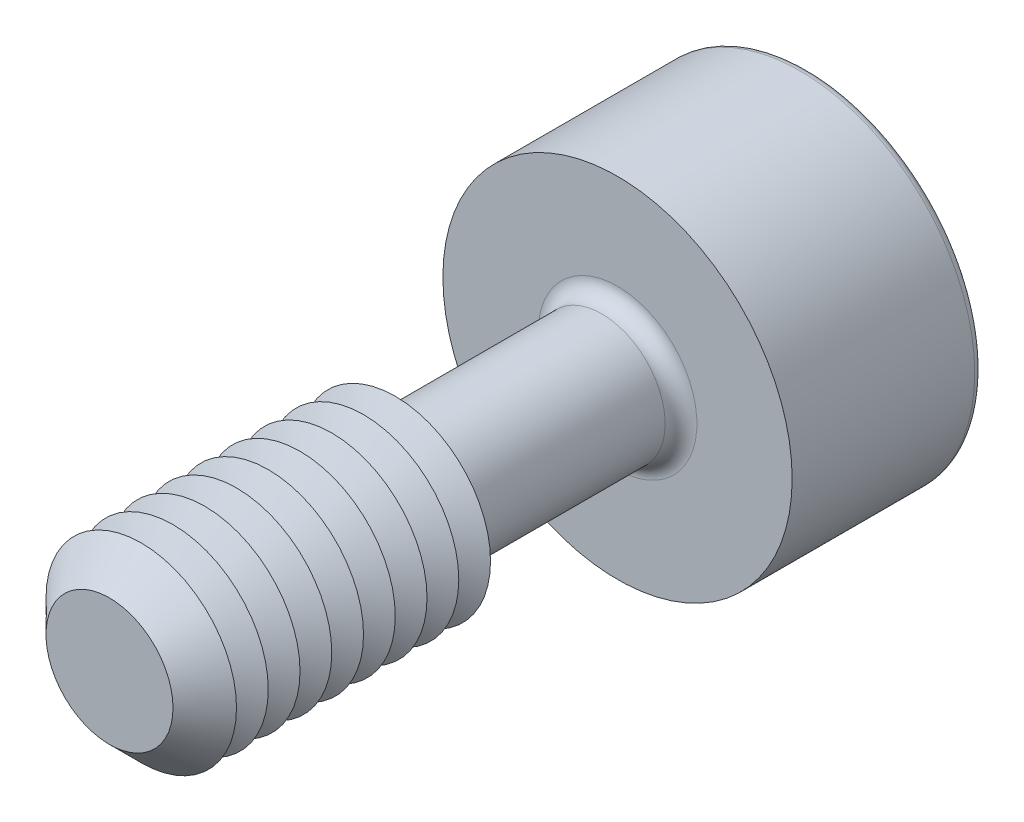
ISO-10303-21;
HEADER;
FILE_DESCRIPTION(('STEP AP214'),'2;1');
FILE_NAME('part.step','',(''),(''),'','','');
FILE_SCHEMA(('AUTOMOTIVE_DESIGN { 1 0 10303 214 1 1 1 1 }'));
ENDSEC;
DATA;
#1=APPLICATION_CONTEXT('core data for automotive mechanical design processes');
#2=APPLICATION_PROTOCOL_DEFINITION('international standard','automotive_design',2000,#1);
#3=PRODUCT_CONTEXT('',#1,'mechanical');
#4=PRODUCT('Part','Part','',(#3));
#5=PRODUCT_RELATED_PRODUCT_CATEGORY('part','',(#4));
#6=PRODUCT_DEFINITION_FORMATION('','',#4);
#7=PRODUCT_DEFINITION_CONTEXT('part definition',#1,'design');
#8=PRODUCT_DEFINITION('design','',#6,#7);
#9=PRODUCT_DEFINITION_SHAPE('','',#8);
#10=(LENGTH_UNIT() NAMED_UNIT(*) SI_UNIT(.MILLI.,.METRE.));
#11=(NAMED_UNIT(*) PLANE_ANGLE_UNIT() SI_UNIT($,.RADIAN.));
#12=(NAMED_UNIT(*) SI_UNIT($,.STERADIAN.) SOLID_ANGLE_UNIT());
#13=UNCERTAINTY_MEASURE_WITH_UNIT(LENGTH_MEASURE(1.E-05),#10,'distance_accuracy_value','');
#14=(GEOMETRIC_REPRESENTATION_CONTEXT(3) GLOBAL_UNCERTAINTY_ASSIGNED_CONTEXT((#13)) GLOBAL_UNIT_ASSIGNED_CONTEXT((#10,
#11,#12)) REPRESENTATION_CONTEXT('',''));
#15=CARTESIAN_POINT('',(0.,0.,0.));
#16=DIRECTION('',(0.,0.,1.));
#17=DIRECTION('',(1.,0.,0.));
#18=AXIS2_PLACEMENT_3D('',#15,#16,#17);
#19=CARTESIAN_POINT('',(-0.721687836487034,-1.25,-4.5));
#20=DIRECTION('',(0.,0.,1.));
#21=DIRECTION('',(1.,0.,0.));
#22=AXIS2_PLACEMENT_3D('',#19,#20,#21);
#23=PLANE('',#22);
#24=DIRECTION('',(1.,0.,0.));
#25=VECTOR('',#24,1.);
#26=CARTESIAN_POINT('',(-0.721687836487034,-1.25,-4.5));
#27=LINE('',#26,#25);
#28=CARTESIAN_POINT('',(0.,-1.25,-4.5));
#29=VERTEX_POINT('',#28);
#30=CARTESIAN_POINT('',(0.721687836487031,-1.25,-4.5));
#31=VERTEX_POINT('',#30);
#32=EDGE_CURVE('E413',#29,#31,#27,.T.);
#33=ORIENTED_EDGE('',*,*,#32,.F.);
#34=CARTESIAN_POINT('',(0.,0.,-4.5));
#35=DIRECTION('',(0.,0.,1.));
#36=DIRECTION('',(0.,-1.,0.));
#37=AXIS2_PLACEMENT_3D('',#34,#35,#36);
#38=CIRCLE('',#37,1.25);
#39=CARTESIAN_POINT('',(1.08253175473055,-0.625000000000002,-4.5));
#40=VERTEX_POINT('',#39);
#41=EDGE_CURVE('E53',#29,#40,#38,.T.);
#42=ORIENTED_EDGE('',*,*,#41,.T.);
#43=DIRECTION('',(0.500000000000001,0.866025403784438,0.));
#44=VECTOR('',#43,1.);
#45=CARTESIAN_POINT('',(0.721687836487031,-1.25,-4.5));
#46=LINE('',#45,#44);
#47=EDGE_CURVE('E401',#31,#40,#46,.T.);
#48=ORIENTED_EDGE('',*,*,#47,.F.);
#49=EDGE_LOOP('',(#33,#42,#48));
#50=FACE_BOUND('',#49,.T.);
#51=ADVANCED_FACE('F41',(#50),#23,.F.);
#52=CARTESIAN_POINT('',(1.44337567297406,0.,-4.5));
#53=VERTEX_POINT('',#52);
#54=EDGE_CURVE('E407',#40,#53,#46,.T.);
#55=ORIENTED_EDGE('',*,*,#54,.F.);
#56=CARTESIAN_POINT('',(1.08253175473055,0.624999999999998,-4.50000000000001));
#57=VERTEX_POINT('',#56);
#58=EDGE_CURVE('E11',#40,#57,#38,.T.);
#59=ORIENTED_EDGE('',*,*,#58,.T.);
#60=DIRECTION('',(-0.5,0.866025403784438,0.));
#61=VECTOR('',#60,1.);
#62=CARTESIAN_POINT('',(1.44337567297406,0.,-4.5));
#63=LINE('',#62,#61);
#64=EDGE_CURVE('E397',#53,#57,#63,.T.);
#65=ORIENTED_EDGE('',*,*,#64,.F.);
#66=EDGE_LOOP('',(#55,#59,#65));
#67=FACE_BOUND('',#66,.T.);
#68=ADVANCED_FACE('F133',(#67),#23,.F.);
#69=CARTESIAN_POINT('',(0.721687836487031,1.25,-4.5));
#70=VERTEX_POINT('',#69);
#71=EDGE_CURVE('E396',#57,#70,#63,.T.);
#72=ORIENTED_EDGE('',*,*,#71,.F.);
#73=CARTESIAN_POINT('',(0.,1.25,-4.50000000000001));
#74=VERTEX_POINT('',#73);
#75=EDGE_CURVE('E51',#57,#74,#38,.T.);
#76=ORIENTED_EDGE('',*,*,#75,.T.);
#77=DIRECTION('',(-1.,0.,0.));
#78=VECTOR('',#77,1.);
#79=CARTESIAN_POINT('',(0.721687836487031,1.25,-4.5));
#80=LINE('',#79,#78);
#81=EDGE_CURVE('E177',#70,#74,#80,.T.);
#82=ORIENTED_EDGE('',*,*,#81,.F.);
#83=EDGE_LOOP('',(#72,#76,#82));
#84=FACE_BOUND('',#83,.T.);
#85=ADVANCED_FACE('F139',(#84),#23,.F.);
#86=CARTESIAN_POINT('',(-0.721687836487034,1.25,-4.5));
#87=VERTEX_POINT('',#86);
#88=EDGE_CURVE('E404',#74,#87,#80,.T.);
#89=ORIENTED_EDGE('',*,*,#88,.F.);
#90=CARTESIAN_POINT('',(-1.08253175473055,0.624999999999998,-4.50000000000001));
#91=VERTEX_POINT('',#90);
#92=EDGE_CURVE('E264',#74,#91,#38,.T.);
#93=ORIENTED_EDGE('',*,*,#92,.T.);
#94=DIRECTION('',(-0.5,-0.866025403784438,0.));
#95=VECTOR('',#94,1.);
#96=CARTESIAN_POINT('',(-0.721687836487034,1.25,-4.5));
#97=LINE('',#96,#95);
#98=EDGE_CURVE('E176',#87,#91,#97,.T.);
#99=ORIENTED_EDGE('',*,*,#98,.F.);
#100=EDGE_LOOP('',(#89,#93,#99));
#101=FACE_BOUND('',#100,.T.);
#102=ADVANCED_FACE('F157',(#101),#23,.F.);
#103=CARTESIAN_POINT('',(-1.44337567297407,0.,-4.5));
#104=VERTEX_POINT('',#103);
#105=EDGE_CURVE('E170',#91,#104,#97,.T.);
#106=ORIENTED_EDGE('',*,*,#105,.F.);
#107=CARTESIAN_POINT('',(-1.08253175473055,-0.625000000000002,-4.5));
#108=VERTEX_POINT('',#107);
#109=EDGE_CURVE('E172',#91,#108,#38,.T.);
#110=ORIENTED_EDGE('',*,*,#109,.T.);
#111=DIRECTION('',(0.5,-0.866025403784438,0.));
#112=VECTOR('',#111,1.);
#113=CARTESIAN_POINT('',(-1.44337567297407,0.,-4.5));
#114=LINE('',#113,#112);
#115=EDGE_CURVE('E174',#104,#108,#114,.T.);
#116=ORIENTED_EDGE('',*,*,#115,.F.);
#117=EDGE_LOOP('',(#106,#110,#116));
#118=FACE_BOUND('',#117,.T.);
#119=ADVANCED_FACE('F146',(#118),#23,.F.);
#120=CARTESIAN_POINT('',(0.,0.,-7.));
#121=DIRECTION('',(0.,0.,-1.));
#122=DIRECTION('',(-1.,0.,0.));
#123=AXIS2_PLACEMENT_3D('',#120,#121,#122);
#124=PLANE('',#123);
#125=CARTESIAN_POINT('',(0.,0.,-7.));
#126=DIRECTION('',(0.,0.,-1.));
#127=DIRECTION('',(-1.,0.,0.));
#128=AXIS2_PLACEMENT_3D('',#125,#126,#127);
#129=CIRCLE('',#128,2.625);
#130=CARTESIAN_POINT('',(-2.625,0.,-7.));
#131=VERTEX_POINT('',#130);
#132=EDGE_CURVE('E250',#131,#131,#129,.T.);
#133=ORIENTED_EDGE('',*,*,#132,.T.);
#134=EDGE_LOOP('',(#133));
#135=FACE_BOUND('',#134,.T.);
#136=DIRECTION('',(-0.5,-0.866025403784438,0.));
#137=VECTOR('',#136,1.);
#138=CARTESIAN_POINT('',(-0.721687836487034,1.25,-7.));
#139=LINE('',#138,#137);
#140=CARTESIAN_POINT('',(-0.721687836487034,1.25,-7.));
#141=VERTEX_POINT('',#140);
#142=CARTESIAN_POINT('',(-1.44337567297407,0.,-7.));
#143=VERTEX_POINT('',#142);
#144=EDGE_CURVE('E212',#141,#143,#139,.T.);
#145=ORIENTED_EDGE('',*,*,#144,.T.);
#146=DIRECTION('',(0.5,-0.866025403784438,0.));
#147=VECTOR('',#146,1.);
#148=CARTESIAN_POINT('',(-1.44337567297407,0.,-7.));
#149=LINE('',#148,#147);
#150=CARTESIAN_POINT('',(-0.721687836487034,-1.25,-7.));
#151=VERTEX_POINT('',#150);
#152=EDGE_CURVE('E67',#143,#151,#149,.T.);
#153=ORIENTED_EDGE('',*,*,#152,.T.);
#154=DIRECTION('',(1.,0.,0.));
#155=VECTOR('',#154,1.);
#156=CARTESIAN_POINT('',(-0.721687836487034,-1.25,-7.));
#157=LINE('',#156,#155);
#158=CARTESIAN_POINT('',(0.721687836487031,-1.25,-7.));
#159=VERTEX_POINT('',#158);
#160=EDGE_CURVE('E196',#151,#159,#157,.T.);
#161=ORIENTED_EDGE('',*,*,#160,.T.);
#162=DIRECTION('',(0.500000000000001,0.866025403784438,0.));
#163=VECTOR('',#162,1.);
#164=CARTESIAN_POINT('',(0.721687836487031,-1.25,-7.));
#165=LINE('',#164,#163);
#166=CARTESIAN_POINT('',(1.44337567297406,0.,-7.));
#167=VERTEX_POINT('',#166);
#168=EDGE_CURVE('E200',#159,#167,#165,.T.);
#169=ORIENTED_EDGE('',*,*,#168,.T.);
#170=DIRECTION('',(-0.5,0.866025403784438,0.));
#171=VECTOR('',#170,1.);
#172=CARTESIAN_POINT('',(1.44337567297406,0.,-7.));
#173=LINE('',#172,#171);
#174=CARTESIAN_POINT('',(0.721687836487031,1.25,-7.));
#175=VERTEX_POINT('',#174);
#176=EDGE_CURVE('E204',#167,#175,#173,.T.);
#177=ORIENTED_EDGE('',*,*,#176,.T.);
#178=DIRECTION('',(-1.,0.,0.));
#179=VECTOR('',#178,1.);
#180=CARTESIAN_POINT('',(0.721687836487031,1.25,-7.));
#181=LINE('',#180,#179);
#182=EDGE_CURVE('E208',#175,#141,#181,.T.);
#183=ORIENTED_EDGE('',*,*,#182,.T.);
#184=EDGE_LOOP('',(#145,#153,#161,#169,#177,#183));
#185=FACE_BOUND('',#184,.T.);
#186=ADVANCED_FACE('F156',(#135,#185),#124,.T.);
#187=CARTESIAN_POINT('',(0.,0.,4.));
#188=DIRECTION('',(0.,0.,-1.));
#189=DIRECTION('',(-1.,0.,0.));
#190=AXIS2_PLACEMENT_3D('',#187,#188,#189);
#191=CYLINDRICAL_SURFACE('',#190,1.);
#192=CARTESIAN_POINT('',(0.,0.,-3.75));
#193=DIRECTION('',(0.,0.,-1.));
#194=DIRECTION('',(-1.,0.,0.));
#195=AXIS2_PLACEMENT_3D('',#192,#193,#194);
#196=CIRCLE('',#195,1.);
#197=CARTESIAN_POINT('',(-1.,0.,-3.75));
#198=VERTEX_POINT('',#197);
#199=EDGE_CURVE('E247',#198,#198,#196,.F.);
#200=ORIENTED_EDGE('',*,*,#199,.T.);
#201=EDGE_LOOP('',(#200));
#202=FACE_BOUND('',#201,.T.);
#203=CARTESIAN_POINT('',(0.,0.,-0.788675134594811));
#204=DIRECTION('',(0.,0.,-1.));
#205=DIRECTION('',(0.,1.,0.));
#206=AXIS2_PLACEMENT_3D('',#203,#204,#205);
#207=CIRCLE('',#206,1.);
#208=CARTESIAN_POINT('',(0.,1.,-0.788675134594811));
#209=VERTEX_POINT('',#208);
#210=EDGE_CURVE('E235',#209,#209,#207,.T.);
#211=ORIENTED_EDGE('',*,*,#210,.T.);
#212=EDGE_LOOP('',(#211));
#213=FACE_BOUND('',#212,.T.);
#214=ADVANCED_FACE('F163',(#202,#213),#191,.T.);
#215=CARTESIAN_POINT('',(0.,0.,-0.788675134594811));
#216=DIRECTION('',(0.,0.,1.));
#217=DIRECTION('',(0.,-1.,0.));
#218=AXIS2_PLACEMENT_3D('',#215,#216,#217);
#219=CONICAL_SURFACE('',#218,1.,1.0471975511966);
#220=CARTESIAN_POINT('',(0.,0.,-0.5));
#221=DIRECTION('',(0.,0.,-1.));
#222=DIRECTION('',(-1.,0.,0.));
#223=AXIS2_PLACEMENT_3D('',#220,#221,#222);
#224=CIRCLE('',#223,1.5);
#225=CARTESIAN_POINT('',(-1.5,0.,-0.5));
#226=VERTEX_POINT('',#225);
#227=EDGE_CURVE('E267',#226,#226,#224,.T.);
#228=ORIENTED_EDGE('',*,*,#227,.T.);
#229=EDGE_LOOP('',(#228));
#230=FACE_BOUND('',#229,.T.);
#231=ORIENTED_EDGE('',*,*,#210,.F.);
#232=EDGE_LOOP('',(#231));
#233=FACE_BOUND('',#232,.T.);
#234=ADVANCED_FACE('F354',(#230,#233),#219,.T.);
#235=CARTESIAN_POINT('',(0.,0.,-4.));
#236=DIRECTION('',(0.,0.,-1.));
#237=DIRECTION('',(-1.,0.,0.));
#238=AXIS2_PLACEMENT_3D('',#235,#236,#237);
#239=PLANE('',#238);
#240=CARTESIAN_POINT('',(0.,0.,-4.));
#241=DIRECTION('',(0.,0.,-1.));
#242=DIRECTION('',(-1.,0.,0.));
#243=AXIS2_PLACEMENT_3D('',#240,#241,#242);
#244=CIRCLE('',#243,1.25);
#245=CARTESIAN_POINT('',(-1.25,0.,-4.));
#246=VERTEX_POINT('',#245);
#247=EDGE_CURVE('E243',#246,#246,#244,.T.);
#248=ORIENTED_EDGE('',*,*,#247,.T.);
#249=EDGE_LOOP('',(#248));
#250=FACE_BOUND('',#249,.T.);
#251=CARTESIAN_POINT('',(0.,0.,-4.));
#252=DIRECTION('',(0.,0.,-1.));
#253=DIRECTION('',(-1.,0.,0.));
#254=AXIS2_PLACEMENT_3D('',#251,#252,#253);
#255=CIRCLE('',#254,2.75);
#256=CARTESIAN_POINT('',(-2.75,0.,-4.));
#257=VERTEX_POINT('',#256);
#258=EDGE_CURVE('E231',#257,#257,#255,.T.);
#259=ORIENTED_EDGE('',*,*,#258,.F.);
#260=EDGE_LOOP('',(#259));
#261=FACE_BOUND('',#260,.T.);
#262=ADVANCED_FACE('F359',(#250,#261),#239,.F.);
#263=CARTESIAN_POINT('',(0.,0.,-7.));
#264=DIRECTION('',(0.,0.,1.));
#265=DIRECTION('',(1.,0.,0.));
#266=AXIS2_PLACEMENT_3D('',#263,#264,#265);
#267=CYLINDRICAL_SURFACE('',#266,2.75);
#268=CARTESIAN_POINT('',(0.,0.,-6.875));
#269=DIRECTION('',(0.,0.,-1.));
#270=DIRECTION('',(-1.,0.,0.));
#271=AXIS2_PLACEMENT_3D('',#268,#269,#270);
#272=CIRCLE('',#271,2.75);
#273=CARTESIAN_POINT('',(-2.75,0.,-6.875));
#274=VERTEX_POINT('',#273);
#275=EDGE_CURVE('E45',#274,#274,#272,.F.);
#276=ORIENTED_EDGE('',*,*,#275,.T.);
#277=EDGE_LOOP('',(#276));
#278=FACE_BOUND('',#277,.T.);
#279=ORIENTED_EDGE('',*,*,#258,.T.);
#280=EDGE_LOOP('',(#279));
#281=FACE_BOUND('',#280,.T.);
#282=ADVANCED_FACE('F360',(#278,#281),#267,.T.);
#283=CARTESIAN_POINT('',(-1.44337567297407,0.,-4.5));
#284=DIRECTION('',(0.866025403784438,0.5,0.));
#285=DIRECTION('',(-0.5,0.866025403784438,0.));
#286=AXIS2_PLACEMENT_3D('',#283,#284,#285);
#287=PLANE('',#286);
#288=ORIENTED_EDGE('',*,*,#152,.F.);
#289=DIRECTION('',(0.,0.,-1.));
#290=VECTOR('',#289,1.);
#291=CARTESIAN_POINT('',(-1.44337567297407,0.,-4.5));
#292=LINE('',#291,#290);
#293=EDGE_CURVE('E186',#104,#143,#292,.T.);
#294=ORIENTED_EDGE('',*,*,#293,.F.);
#295=ORIENTED_EDGE('',*,*,#115,.T.);
#296=CARTESIAN_POINT('',(-0.721687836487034,-1.25,-4.5));
#297=VERTEX_POINT('',#296);
#298=EDGE_CURVE('E215',#108,#297,#114,.T.);
#299=ORIENTED_EDGE('',*,*,#298,.T.);
#300=DIRECTION('',(0.,0.,-1.));
#301=VECTOR('',#300,1.);
#302=CARTESIAN_POINT('',(-0.721687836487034,-1.25,-4.5));
#303=LINE('',#302,#301);
#304=EDGE_CURVE('E228',#297,#151,#303,.T.);
#305=ORIENTED_EDGE('',*,*,#304,.T.);
#306=EDGE_LOOP('',(#288,#294,#295,#299,#305));
#307=FACE_BOUND('',#306,.T.);
#308=ADVANCED_FACE('F363',(#307),#287,.T.);
#309=CARTESIAN_POINT('',(-0.721687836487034,-1.25,-4.5));
#310=DIRECTION('',(0.,1.,0.));
#311=DIRECTION('',(0.,0.,1.));
#312=AXIS2_PLACEMENT_3D('',#309,#310,#311);
#313=PLANE('',#312);
#314=ORIENTED_EDGE('',*,*,#160,.F.);
#315=ORIENTED_EDGE('',*,*,#304,.F.);
#316=EDGE_CURVE('E410',#297,#29,#27,.T.);
#317=ORIENTED_EDGE('',*,*,#316,.T.);
#318=ORIENTED_EDGE('',*,*,#32,.T.);
#319=DIRECTION('',(0.,0.,-1.));
#320=VECTOR('',#319,1.);
#321=CARTESIAN_POINT('',(0.721687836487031,-1.25,-4.5));
#322=LINE('',#321,#320);
#323=EDGE_CURVE('E225',#31,#159,#322,.T.);
#324=ORIENTED_EDGE('',*,*,#323,.T.);
#325=EDGE_LOOP('',(#314,#315,#317,#318,#324));
#326=FACE_BOUND('',#325,.T.);
#327=ADVANCED_FACE('F369',(#326),#313,.T.);
#328=CARTESIAN_POINT('',(0.721687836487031,-1.25,-4.5));
#329=DIRECTION('',(-0.866025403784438,0.500000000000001,0.));
#330=DIRECTION('',(-0.500000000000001,-0.866025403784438,0.));
#331=AXIS2_PLACEMENT_3D('',#328,#329,#330);
#332=PLANE('',#331);
#333=ORIENTED_EDGE('',*,*,#168,.F.);
#334=ORIENTED_EDGE('',*,*,#323,.F.);
#335=ORIENTED_EDGE('',*,*,#47,.T.);
#336=ORIENTED_EDGE('',*,*,#54,.T.);
#337=DIRECTION('',(0.,0.,-1.));
#338=VECTOR('',#337,1.);
#339=CARTESIAN_POINT('',(1.44337567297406,0.,-4.5));
#340=LINE('',#339,#338);
#341=EDGE_CURVE('E222',#53,#167,#340,.T.);
#342=ORIENTED_EDGE('',*,*,#341,.T.);
#343=EDGE_LOOP('',(#333,#334,#335,#336,#342));
#344=FACE_BOUND('',#343,.T.);
#345=ADVANCED_FACE('F372',(#344),#332,.T.);
#346=CARTESIAN_POINT('',(1.44337567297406,0.,-4.5));
#347=DIRECTION('',(-0.866025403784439,-0.5,0.));
#348=DIRECTION('',(0.5,-0.866025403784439,0.));
#349=AXIS2_PLACEMENT_3D('',#346,#347,#348);
#350=PLANE('',#349);
#351=ORIENTED_EDGE('',*,*,#176,.F.);
#352=ORIENTED_EDGE('',*,*,#341,.F.);
#353=ORIENTED_EDGE('',*,*,#64,.T.);
#354=ORIENTED_EDGE('',*,*,#71,.T.);
#355=DIRECTION('',(0.,0.,-1.));
#356=VECTOR('',#355,1.);
#357=CARTESIAN_POINT('',(0.721687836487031,1.25,-4.5));
#358=LINE('',#357,#356);
#359=EDGE_CURVE('E219',#70,#175,#358,.T.);
#360=ORIENTED_EDGE('',*,*,#359,.T.);
#361=EDGE_LOOP('',(#351,#352,#353,#354,#360));
#362=FACE_BOUND('',#361,.T.);
#363=ADVANCED_FACE('F376',(#362),#350,.T.);
#364=CARTESIAN_POINT('',(0.721687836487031,1.25,-4.5));
#365=DIRECTION('',(0.,-1.,0.));
#366=DIRECTION('',(0.,0.,-1.));
#367=AXIS2_PLACEMENT_3D('',#364,#365,#366);
#368=PLANE('',#367);
#369=ORIENTED_EDGE('',*,*,#182,.F.);
#370=ORIENTED_EDGE('',*,*,#359,.F.);
#371=ORIENTED_EDGE('',*,*,#81,.T.);
#372=ORIENTED_EDGE('',*,*,#88,.T.);
#373=DIRECTION('',(0.,0.,-1.));
#374=VECTOR('',#373,1.);
#375=CARTESIAN_POINT('',(-0.721687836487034,1.25,-4.5));
#376=LINE('',#375,#374);
#377=EDGE_CURVE('E182',#87,#141,#376,.T.);
#378=ORIENTED_EDGE('',*,*,#377,.T.);
#379=EDGE_LOOP('',(#369,#370,#371,#372,#378));
#380=FACE_BOUND('',#379,.T.);
#381=ADVANCED_FACE('F152',(#380),#368,.T.);
#382=CARTESIAN_POINT('',(-0.721687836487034,1.25,-4.5));
#383=DIRECTION('',(0.866025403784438,-0.5,0.));
#384=DIRECTION('',(0.5,0.866025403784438,0.));
#385=AXIS2_PLACEMENT_3D('',#382,#383,#384);
#386=PLANE('',#385);
#387=ORIENTED_EDGE('',*,*,#144,.F.);
#388=ORIENTED_EDGE('',*,*,#377,.F.);
#389=ORIENTED_EDGE('',*,*,#98,.T.);
#390=ORIENTED_EDGE('',*,*,#105,.T.);
#391=ORIENTED_EDGE('',*,*,#293,.T.);
#392=EDGE_LOOP('',(#387,#388,#389,#390,#391));
#393=FACE_BOUND('',#392,.T.);
#394=ADVANCED_FACE('F144',(#393),#386,.T.);
#395=ORIENTED_EDGE('',*,*,#298,.F.);
#396=EDGE_CURVE('E256',#108,#29,#38,.T.);
#397=ORIENTED_EDGE('',*,*,#396,.T.);
#398=ORIENTED_EDGE('',*,*,#316,.F.);
#399=EDGE_LOOP('',(#395,#397,#398));
#400=FACE_BOUND('',#399,.T.);
#401=ADVANCED_FACE('F135',(#400),#23,.F.);
#402=CARTESIAN_POINT('',(0.,0.,-3.75));
#403=DIRECTION('',(0.,0.,-1.));
#404=DIRECTION('',(-1.,0.,0.));
#405=AXIS2_PLACEMENT_3D('',#402,#403,#404);
#406=TOROIDAL_SURFACE('',#405,1.25,0.25);
#407=ORIENTED_EDGE('',*,*,#199,.F.);
#408=EDGE_LOOP('',(#407));
#409=FACE_BOUND('',#408,.T.);
#410=ORIENTED_EDGE('',*,*,#247,.F.);
#411=EDGE_LOOP('',(#410));
#412=FACE_BOUND('',#411,.T.);
#413=ADVANCED_FACE('F129',(#409,#412),#406,.F.);
#414=CARTESIAN_POINT('',(0.,0.,-6.875));
#415=DIRECTION('',(0.,0.,-1.));
#416=DIRECTION('',(-1.,0.,0.));
#417=AXIS2_PLACEMENT_3D('',#414,#415,#416);
#418=TOROIDAL_SURFACE('',#417,2.625,0.125);
#419=ORIENTED_EDGE('',*,*,#275,.F.);
#420=EDGE_LOOP('',(#419));
#421=FACE_BOUND('',#420,.T.);
#422=ORIENTED_EDGE('',*,*,#132,.F.);
#423=EDGE_LOOP('',(#422));
#424=FACE_BOUND('',#423,.T.);
#425=ADVANCED_FACE('F43',(#421,#424),#418,.T.);
#426=CARTESIAN_POINT('',(0.,0.,-3.77831216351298));
#427=DIRECTION('',(0.,0.,-1.));
#428=DIRECTION('',(0.,1.,0.));
#429=AXIS2_PLACEMENT_3D('',#426,#427,#428);
#430=CONICAL_SURFACE('',#429,0.,1.0471975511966);
#431=ORIENTED_EDGE('',*,*,#41,.F.);
#432=ORIENTED_EDGE('',*,*,#396,.F.);
#433=ORIENTED_EDGE('',*,*,#109,.F.);
#434=ORIENTED_EDGE('',*,*,#92,.F.);
#435=ORIENTED_EDGE('',*,*,#75,.F.);
#436=ORIENTED_EDGE('',*,*,#58,.F.);
#437=EDGE_LOOP('',(#431,#432,#433,#434,#435,#436));
#438=FACE_BOUND('',#437,.T.);
#439=CARTESIAN_POINT('',(0.,0.,-3.77831216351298));
#440=VERTEX_POINT('',#439);
#441=VERTEX_LOOP('',#440);
#442=FACE_BOUND('',#441,.T.);
#443=ADVANCED_FACE('F118',(#438,#442),#430,.F.);
#444=CARTESIAN_POINT('',(0.,0.,-0.249999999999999));
#445=DIRECTION('',(0.,0.,-1.));
#446=DIRECTION('',(-1.,0.,0.));
#447=AXIS2_PLACEMENT_3D('',#444,#445,#446);
#448=CONICAL_SURFACE('',#447,1.06698729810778,1.0471975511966);
#449=ORIENTED_EDGE('',*,*,#227,.F.);
#450=EDGE_LOOP('',(#449));
#451=FACE_BOUND('',#450,.T.);
#452=CARTESIAN_POINT('',(0.,0.,-0.249999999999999));
#453=DIRECTION('',(0.,0.,-1.));
#454=DIRECTION('',(-1.,0.,0.));
#455=AXIS2_PLACEMENT_3D('',#452,#453,#454);
#456=CIRCLE('',#455,1.06698729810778);
#457=CARTESIAN_POINT('',(-1.06698729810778,0.,-0.249999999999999));
#458=VERTEX_POINT('',#457);
#459=EDGE_CURVE('E273',#458,#458,#456,.T.);
#460=ORIENTED_EDGE('',*,*,#459,.T.);
#461=EDGE_LOOP('',(#460));
#462=FACE_BOUND('',#461,.T.);
#463=ADVANCED_FACE('F120',(#451,#462),#448,.T.);
#464=CARTESIAN_POINT('',(0.,0.,0.));
#465=DIRECTION('',(0.,0.,1.));
#466=DIRECTION('',(1.,0.,0.));
#467=AXIS2_PLACEMENT_3D('',#464,#465,#466);
#468=CONICAL_SURFACE('',#467,1.5,1.0471975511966);
#469=ORIENTED_EDGE('',*,*,#459,.F.);
#470=EDGE_LOOP('',(#469));
#471=FACE_BOUND('',#470,.T.);
#472=CARTESIAN_POINT('',(0.,0.,0.));
#473=DIRECTION('',(0.,0.,-1.));
#474=DIRECTION('',(-1.,0.,0.));
#475=AXIS2_PLACEMENT_3D('',#472,#473,#474);
#476=CIRCLE('',#475,1.5);
#477=CARTESIAN_POINT('',(-1.5,0.,0.));
#478=VERTEX_POINT('',#477);
#479=EDGE_CURVE('E280',#478,#478,#476,.T.);
#480=ORIENTED_EDGE('',*,*,#479,.T.);
#481=EDGE_LOOP('',(#480));
#482=FACE_BOUND('',#481,.T.);
#483=ADVANCED_FACE('F126',(#471,#482),#468,.T.);
#484=CARTESIAN_POINT('',(0.,0.,0.250000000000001));
#485=DIRECTION('',(0.,0.,-1.));
#486=DIRECTION('',(-1.,0.,0.));
#487=AXIS2_PLACEMENT_3D('',#484,#485,#486);
#488=CONICAL_SURFACE('',#487,1.06698729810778,1.0471975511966);
#489=ORIENTED_EDGE('',*,*,#479,.F.);
#490=EDGE_LOOP('',(#489));
#491=FACE_BOUND('',#490,.T.);
#492=CARTESIAN_POINT('',(0.,0.,0.250000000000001));
#493=DIRECTION('',(0.,0.,-1.));
#494=DIRECTION('',(-1.,0.,0.));
#495=AXIS2_PLACEMENT_3D('',#492,#493,#494);
#496=CIRCLE('',#495,1.06698729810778);
#497=CARTESIAN_POINT('',(-1.06698729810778,0.,0.250000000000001));
#498=VERTEX_POINT('',#497);
#499=EDGE_CURVE('E286',#498,#498,#496,.T.);
#500=ORIENTED_EDGE('',*,*,#499,.T.);
#501=EDGE_LOOP('',(#500));
#502=FACE_BOUND('',#501,.T.);
#503=ADVANCED_FACE('F516',(#491,#502),#488,.T.);
#504=CARTESIAN_POINT('',(0.,0.,0.5));
#505=DIRECTION('',(0.,0.,1.));
#506=DIRECTION('',(1.,0.,0.));
#507=AXIS2_PLACEMENT_3D('',#504,#505,#506);
#508=CONICAL_SURFACE('',#507,1.5,1.0471975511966);
#509=ORIENTED_EDGE('',*,*,#499,.F.);
#510=EDGE_LOOP('',(#509));
#511=FACE_BOUND('',#510,.T.);
#512=CARTESIAN_POINT('',(0.,0.,0.5));
#513=DIRECTION('',(0.,0.,-1.));
#514=DIRECTION('',(-1.,0.,0.));
#515=AXIS2_PLACEMENT_3D('',#512,#513,#514);
#516=CIRCLE('',#515,1.5);
#517=CARTESIAN_POINT('',(-1.5,0.,0.5));
#518=VERTEX_POINT('',#517);
#519=EDGE_CURVE('E290',#518,#518,#516,.T.);
#520=ORIENTED_EDGE('',*,*,#519,.T.);
#521=EDGE_LOOP('',(#520));
#522=FACE_BOUND('',#521,.T.);
#523=ADVANCED_FACE('F525',(#511,#522),#508,.T.);
#524=CARTESIAN_POINT('',(0.,0.,0.750000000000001));
#525=DIRECTION('',(0.,0.,-1.));
#526=DIRECTION('',(-1.,0.,0.));
#527=AXIS2_PLACEMENT_3D('',#524,#525,#526);
#528=CONICAL_SURFACE('',#527,1.06698729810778,1.0471975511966);
#529=ORIENTED_EDGE('',*,*,#519,.F.);
#530=EDGE_LOOP('',(#529));
#531=FACE_BOUND('',#530,.T.);
#532=CARTESIAN_POINT('',(0.,0.,0.750000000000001));
#533=DIRECTION('',(0.,0.,-1.));
#534=DIRECTION('',(-1.,0.,0.));
#535=AXIS2_PLACEMENT_3D('',#532,#533,#534);
#536=CIRCLE('',#535,1.06698729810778);
#537=CARTESIAN_POINT('',(-1.06698729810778,0.,0.750000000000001));
#538=VERTEX_POINT('',#537);
#539=EDGE_CURVE('E294',#538,#538,#536,.T.);
#540=ORIENTED_EDGE('',*,*,#539,.T.);
#541=EDGE_LOOP('',(#540));
#542=FACE_BOUND('',#541,.T.);
#543=ADVANCED_FACE('F534',(#531,#542),#528,.T.);
#544=CARTESIAN_POINT('',(0.,0.,1.));
#545=DIRECTION('',(0.,0.,1.));
#546=DIRECTION('',(1.,0.,0.));
#547=AXIS2_PLACEMENT_3D('',#544,#545,#546);
#548=CONICAL_SURFACE('',#547,1.5,1.0471975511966);
#549=ORIENTED_EDGE('',*,*,#539,.F.);
#550=EDGE_LOOP('',(#549));
#551=FACE_BOUND('',#550,.T.);
#552=CARTESIAN_POINT('',(0.,0.,1.));
#553=DIRECTION('',(0.,0.,-1.));
#554=DIRECTION('',(-1.,0.,0.));
#555=AXIS2_PLACEMENT_3D('',#552,#553,#554);
#556=CIRCLE('',#555,1.5);
#557=CARTESIAN_POINT('',(-1.5,0.,1.));
#558=VERTEX_POINT('',#557);
#559=EDGE_CURVE('E298',#558,#558,#556,.T.);
#560=ORIENTED_EDGE('',*,*,#559,.T.);
#561=EDGE_LOOP('',(#560));
#562=FACE_BOUND('',#561,.T.);
#563=ADVANCED_FACE('F543',(#551,#562),#548,.T.);
#564=CARTESIAN_POINT('',(0.,0.,1.25));
#565=DIRECTION('',(0.,0.,-1.));
#566=DIRECTION('',(-1.,0.,0.));
#567=AXIS2_PLACEMENT_3D('',#564,#565,#566);
#568=CONICAL_SURFACE('',#567,1.06698729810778,1.0471975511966);
#569=ORIENTED_EDGE('',*,*,#559,.F.);
#570=EDGE_LOOP('',(#569));
#571=FACE_BOUND('',#570,.T.);
#572=CARTESIAN_POINT('',(0.,0.,1.25));
#573=DIRECTION('',(0.,0.,-1.));
#574=DIRECTION('',(-1.,0.,0.));
#575=AXIS2_PLACEMENT_3D('',#572,#573,#574);
#576=CIRCLE('',#575,1.06698729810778);
#577=CARTESIAN_POINT('',(-1.06698729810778,0.,1.25));
#578=VERTEX_POINT('',#577);
#579=EDGE_CURVE('E302',#578,#578,#576,.T.);
#580=ORIENTED_EDGE('',*,*,#579,.T.);
#581=EDGE_LOOP('',(#580));
#582=FACE_BOUND('',#581,.T.);
#583=ADVANCED_FACE('F552',(#571,#582),#568,.T.);
#584=CARTESIAN_POINT('',(0.,0.,1.5));
#585=DIRECTION('',(0.,0.,1.));
#586=DIRECTION('',(1.,0.,0.));
#587=AXIS2_PLACEMENT_3D('',#584,#585,#586);
#588=CONICAL_SURFACE('',#587,1.5,1.0471975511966);
#589=ORIENTED_EDGE('',*,*,#579,.F.);
#590=EDGE_LOOP('',(#589));
#591=FACE_BOUND('',#590,.T.);
#592=CARTESIAN_POINT('',(0.,0.,1.5));
#593=DIRECTION('',(0.,0.,-1.));
#594=DIRECTION('',(-1.,0.,0.));
#595=AXIS2_PLACEMENT_3D('',#592,#593,#594);
#596=CIRCLE('',#595,1.5);
#597=CARTESIAN_POINT('',(-1.5,0.,1.5));
#598=VERTEX_POINT('',#597);
#599=EDGE_CURVE('E306',#598,#598,#596,.T.);
#600=ORIENTED_EDGE('',*,*,#599,.T.);
#601=EDGE_LOOP('',(#600));
#602=FACE_BOUND('',#601,.T.);
#603=ADVANCED_FACE('F561',(#591,#602),#588,.T.);
#604=CARTESIAN_POINT('',(0.,0.,1.75));
#605=DIRECTION('',(0.,0.,-1.));
#606=DIRECTION('',(-1.,0.,0.));
#607=AXIS2_PLACEMENT_3D('',#604,#605,#606);
#608=CONICAL_SURFACE('',#607,1.06698729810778,1.0471975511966);
#609=ORIENTED_EDGE('',*,*,#599,.F.);
#610=EDGE_LOOP('',(#609));
#611=FACE_BOUND('',#610,.T.);
#612=CARTESIAN_POINT('',(0.,0.,1.75));
#613=DIRECTION('',(0.,0.,-1.));
#614=DIRECTION('',(-1.,0.,0.));
#615=AXIS2_PLACEMENT_3D('',#612,#613,#614);
#616=CIRCLE('',#615,1.06698729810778);
#617=CARTESIAN_POINT('',(-1.06698729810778,0.,1.75));
#618=VERTEX_POINT('',#617);
#619=EDGE_CURVE('E309',#618,#618,#616,.T.);
#620=ORIENTED_EDGE('',*,*,#619,.T.);
#621=EDGE_LOOP('',(#620));
#622=FACE_BOUND('',#621,.T.);
#623=ADVANCED_FACE('F570',(#611,#622),#608,.T.);
#624=CARTESIAN_POINT('',(0.,0.,2.));
#625=DIRECTION('',(0.,0.,1.));
#626=DIRECTION('',(1.,0.,0.));
#627=AXIS2_PLACEMENT_3D('',#624,#625,#626);
#628=CONICAL_SURFACE('',#627,1.5,1.0471975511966);
#629=ORIENTED_EDGE('',*,*,#619,.F.);
#630=EDGE_LOOP('',(#629));
#631=FACE_BOUND('',#630,.T.);
#632=CARTESIAN_POINT('',(0.,0.,2.));
#633=DIRECTION('',(0.,0.,-1.));
#634=DIRECTION('',(-1.,0.,0.));
#635=AXIS2_PLACEMENT_3D('',#632,#633,#634);
#636=CIRCLE('',#635,1.5);
#637=CARTESIAN_POINT('',(-1.5,0.,2.));
#638=VERTEX_POINT('',#637);
#639=EDGE_CURVE('E313',#638,#638,#636,.T.);
#640=ORIENTED_EDGE('',*,*,#639,.T.);
#641=EDGE_LOOP('',(#640));
#642=FACE_BOUND('',#641,.T.);
#643=ADVANCED_FACE('F579',(#631,#642),#628,.T.);
#644=CARTESIAN_POINT('',(0.,0.,2.25));
#645=DIRECTION('',(0.,0.,-1.));
#646=DIRECTION('',(-1.,0.,0.));
#647=AXIS2_PLACEMENT_3D('',#644,#645,#646);
#648=CONICAL_SURFACE('',#647,1.06698729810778,1.0471975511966);
#649=ORIENTED_EDGE('',*,*,#639,.F.);
#650=EDGE_LOOP('',(#649));
#651=FACE_BOUND('',#650,.T.);
#652=CARTESIAN_POINT('',(0.,0.,2.25));
#653=DIRECTION('',(0.,0.,-1.));
#654=DIRECTION('',(-1.,0.,0.));
#655=AXIS2_PLACEMENT_3D('',#652,#653,#654);
#656=CIRCLE('',#655,1.06698729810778);
#657=CARTESIAN_POINT('',(-1.06698729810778,0.,2.25));
#658=VERTEX_POINT('',#657);
#659=EDGE_CURVE('E317',#658,#658,#656,.T.);
#660=ORIENTED_EDGE('',*,*,#659,.T.);
#661=EDGE_LOOP('',(#660));
#662=FACE_BOUND('',#661,.T.);
#663=ADVANCED_FACE('F588',(#651,#662),#648,.T.);
#664=CARTESIAN_POINT('',(0.,0.,2.5));
#665=DIRECTION('',(0.,0.,1.));
#666=DIRECTION('',(1.,0.,0.));
#667=AXIS2_PLACEMENT_3D('',#664,#665,#666);
#668=CONICAL_SURFACE('',#667,1.5,1.0471975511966);
#669=ORIENTED_EDGE('',*,*,#659,.F.);
#670=EDGE_LOOP('',(#669));
#671=FACE_BOUND('',#670,.T.);
#672=CARTESIAN_POINT('',(0.,0.,2.5));
#673=DIRECTION('',(0.,0.,-1.));
#674=DIRECTION('',(-1.,0.,0.));
#675=AXIS2_PLACEMENT_3D('',#672,#673,#674);
#676=CIRCLE('',#675,1.5);
#677=CARTESIAN_POINT('',(-1.5,0.,2.5));
#678=VERTEX_POINT('',#677);
#679=EDGE_CURVE('E321',#678,#678,#676,.T.);
#680=ORIENTED_EDGE('',*,*,#679,.T.);
#681=EDGE_LOOP('',(#680));
#682=FACE_BOUND('',#681,.T.);
#683=ADVANCED_FACE('F597',(#671,#682),#668,.T.);
#684=CARTESIAN_POINT('',(0.,0.,2.75));
#685=DIRECTION('',(0.,0.,-1.));
#686=DIRECTION('',(-1.,0.,0.));
#687=AXIS2_PLACEMENT_3D('',#684,#685,#686);
#688=CONICAL_SURFACE('',#687,1.06698729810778,1.0471975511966);
#689=ORIENTED_EDGE('',*,*,#679,.F.);
#690=EDGE_LOOP('',(#689));
#691=FACE_BOUND('',#690,.T.);
#692=CARTESIAN_POINT('',(0.,0.,2.75));
#693=DIRECTION('',(0.,0.,-1.));
#694=DIRECTION('',(-1.,0.,0.));
#695=AXIS2_PLACEMENT_3D('',#692,#693,#694);
#696=CIRCLE('',#695,1.06698729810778);
#697=CARTESIAN_POINT('',(-1.06698729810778,0.,2.75));
#698=VERTEX_POINT('',#697);
#699=EDGE_CURVE('E325',#698,#698,#696,.T.);
#700=ORIENTED_EDGE('',*,*,#699,.T.);
#701=EDGE_LOOP('',(#700));
#702=FACE_BOUND('',#701,.T.);
#703=ADVANCED_FACE('F606',(#691,#702),#688,.T.);
#704=CARTESIAN_POINT('',(0.,0.,3.));
#705=DIRECTION('',(0.,0.,1.));
#706=DIRECTION('',(1.,0.,0.));
#707=AXIS2_PLACEMENT_3D('',#704,#705,#706);
#708=CONICAL_SURFACE('',#707,1.5,1.0471975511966);
#709=ORIENTED_EDGE('',*,*,#699,.F.);
#710=EDGE_LOOP('',(#709));
#711=FACE_BOUND('',#710,.T.);
#712=CARTESIAN_POINT('',(0.,0.,3.));
#713=DIRECTION('',(0.,0.,-1.));
#714=DIRECTION('',(-1.,0.,0.));
#715=AXIS2_PLACEMENT_3D('',#712,#713,#714);
#716=CIRCLE('',#715,1.5);
#717=CARTESIAN_POINT('',(-1.5,0.,3.));
#718=VERTEX_POINT('',#717);
#719=EDGE_CURVE('E328',#718,#718,#716,.T.);
#720=ORIENTED_EDGE('',*,*,#719,.T.);
#721=EDGE_LOOP('',(#720));
#722=FACE_BOUND('',#721,.T.);
#723=ADVANCED_FACE('F615',(#711,#722),#708,.T.);
#724=CARTESIAN_POINT('',(0.,0.,3.25));
#725=DIRECTION('',(0.,0.,-1.));
#726=DIRECTION('',(-1.,0.,0.));
#727=AXIS2_PLACEMENT_3D('',#724,#725,#726);
#728=CONICAL_SURFACE('',#727,1.06698729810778,1.0471975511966);
#729=ORIENTED_EDGE('',*,*,#719,.F.);
#730=EDGE_LOOP('',(#729));
#731=FACE_BOUND('',#730,.T.);
#732=CARTESIAN_POINT('',(0.,0.,3.25));
#733=DIRECTION('',(0.,0.,-1.));
#734=DIRECTION('',(-1.,0.,0.));
#735=AXIS2_PLACEMENT_3D('',#732,#733,#734);
#736=CIRCLE('',#735,1.06698729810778);
#737=CARTESIAN_POINT('',(-1.06698729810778,0.,3.25));
#738=VERTEX_POINT('',#737);
#739=EDGE_CURVE('E331',#738,#738,#736,.T.);
#740=ORIENTED_EDGE('',*,*,#739,.T.);
#741=EDGE_LOOP('',(#740));
#742=FACE_BOUND('',#741,.T.);
#743=ADVANCED_FACE('F624',(#731,#742),#728,.T.);
#744=CARTESIAN_POINT('',(0.,0.,3.5));
#745=DIRECTION('',(0.,0.,1.));
#746=DIRECTION('',(1.,0.,0.));
#747=AXIS2_PLACEMENT_3D('',#744,#745,#746);
#748=CONICAL_SURFACE('',#747,1.5,1.0471975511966);
#749=ORIENTED_EDGE('',*,*,#739,.F.);
#750=EDGE_LOOP('',(#749));
#751=FACE_BOUND('',#750,.T.);
#752=CARTESIAN_POINT('',(0.,0.,3.5));
#753=DIRECTION('',(0.,0.,-1.));
#754=DIRECTION('',(-1.,0.,0.));
#755=AXIS2_PLACEMENT_3D('',#752,#753,#754);
#756=CIRCLE('',#755,1.5);
#757=CARTESIAN_POINT('',(-1.5,0.,3.5));
#758=VERTEX_POINT('',#757);
#759=EDGE_CURVE('E334',#758,#758,#756,.T.);
#760=ORIENTED_EDGE('',*,*,#759,.T.);
#761=EDGE_LOOP('',(#760));
#762=FACE_BOUND('',#761,.T.);
#763=ADVANCED_FACE('F339',(#751,#762),#748,.T.);
#764=CARTESIAN_POINT('',(0.,0.,4.));
#765=DIRECTION('',(0.,0.,1.));
#766=DIRECTION('',(1.,0.,0.));
#767=AXIS2_PLACEMENT_3D('',#764,#765,#766);
#768=PLANE('',#767);
#769=CARTESIAN_POINT('',(0.,0.,4.));
#770=DIRECTION('',(0.,0.,1.));
#771=DIRECTION('',(1.,0.,0.));
#772=AXIS2_PLACEMENT_3D('',#769,#770,#771);
#773=CIRCLE('',#772,1.);
#774=CARTESIAN_POINT('',(1.,0.,4.));
#775=VERTEX_POINT('',#774);
#776=EDGE_CURVE('E239',#775,#775,#773,.T.);
#777=ORIENTED_EDGE('',*,*,#776,.T.);
#778=EDGE_LOOP('',(#777));
#779=FACE_BOUND('',#778,.T.);
#780=ADVANCED_FACE('F343',(#779),#768,.T.);
#781=CARTESIAN_POINT('',(0.,0.,3.5));
#782=DIRECTION('',(0.,0.,-1.));
#783=DIRECTION('',(0.,1.,0.));
#784=AXIS2_PLACEMENT_3D('',#781,#782,#783);
#785=CONICAL_SURFACE('',#784,1.5,0.78539816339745);
#786=ORIENTED_EDGE('',*,*,#776,.F.);
#787=EDGE_LOOP('',(#786));
#788=FACE_BOUND('',#787,.T.);
#789=ORIENTED_EDGE('',*,*,#759,.F.);
#790=EDGE_LOOP('',(#789));
#791=FACE_BOUND('',#790,.T.);
#792=ADVANCED_FACE('F341',(#788,#791),#785,.T.);
#793=CLOSED_SHELL('',(#51,#68,#85,#102,#119,#186,#214,#234,#262,#282,#308,#327,#345,#363,#381,
#394,#401,#413,#425,#443,#463,#483,#503,#523,#543,#563,#583,#603,#623,#643,#663,#683,#703,#723,
#743,#763,#780,#792));
#794=MANIFOLD_SOLID_BREP('B2',#793);
#795=ADVANCED_BREP_SHAPE_REPRESENTATION('',(#18,#794),#14);
#796=SHAPE_DEFINITION_REPRESENTATION(#9,#795);
ENDSEC;
END-ISO-10303-21;
